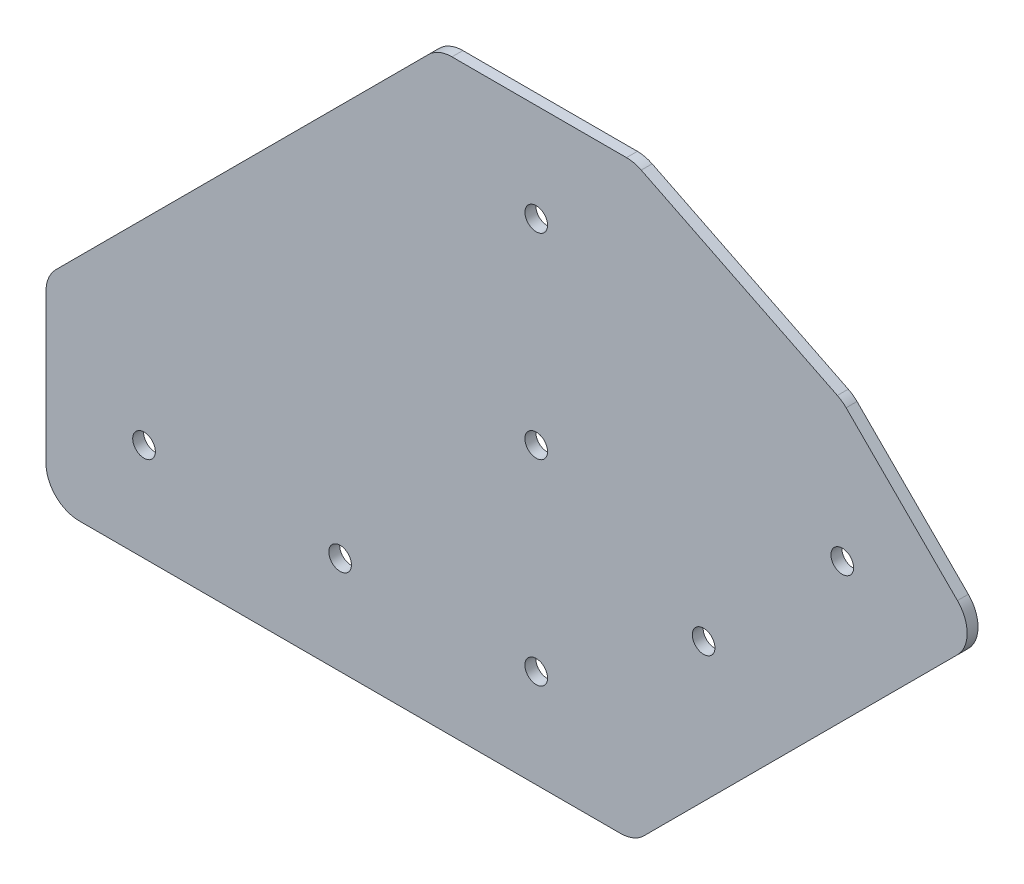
ISO-10303-21;
HEADER;
FILE_DESCRIPTION(('STEP AP214'),'2;1');
FILE_NAME('part.step','',(''),(''),'','','');
FILE_SCHEMA(('AUTOMOTIVE_DESIGN { 1 0 10303 214 1 1 1 1 }'));
ENDSEC;
DATA;
#1=APPLICATION_CONTEXT('core data for automotive mechanical design processes');
#2=APPLICATION_PROTOCOL_DEFINITION('international standard','automotive_design',2000,#1);
#3=PRODUCT_CONTEXT('',#1,'mechanical');
#4=PRODUCT('Part','Part','',(#3));
#5=PRODUCT_RELATED_PRODUCT_CATEGORY('part','',(#4));
#6=PRODUCT_DEFINITION_FORMATION('','',#4);
#7=PRODUCT_DEFINITION_CONTEXT('part definition',#1,'design');
#8=PRODUCT_DEFINITION('design','',#6,#7);
#9=PRODUCT_DEFINITION_SHAPE('','',#8);
#10=(LENGTH_UNIT() NAMED_UNIT(*) SI_UNIT(.MILLI.,.METRE.));
#11=(NAMED_UNIT(*) PLANE_ANGLE_UNIT() SI_UNIT($,.RADIAN.));
#12=(NAMED_UNIT(*) SI_UNIT($,.STERADIAN.) SOLID_ANGLE_UNIT());
#13=UNCERTAINTY_MEASURE_WITH_UNIT(LENGTH_MEASURE(1.E-05),#10,'distance_accuracy_value','');
#14=(GEOMETRIC_REPRESENTATION_CONTEXT(3) GLOBAL_UNCERTAINTY_ASSIGNED_CONTEXT((#13)) GLOBAL_UNIT_ASSIGNED_CONTEXT((#10,
#11,#12)) REPRESENTATION_CONTEXT('',''));
#15=CARTESIAN_POINT('',(0.,0.,0.));
#16=DIRECTION('',(0.,0.,1.));
#17=DIRECTION('',(1.,0.,0.));
#18=AXIS2_PLACEMENT_3D('',#15,#16,#17);
#19=CARTESIAN_POINT('',(4.841875,0.,0.));
#20=DIRECTION('',(0.,1.,0.));
#21=DIRECTION('',(0.,0.,1.));
#22=AXIS2_PLACEMENT_3D('',#19,#20,#21);
#23=PLANE('',#22);
#24=DIRECTION('',(0.,0.,-1.));
#25=VECTOR('',#24,1.);
#26=CARTESIAN_POINT('',(83.7194297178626,0.,0.79375));
#27=LINE('',#26,#25);
#28=CARTESIAN_POINT('',(83.7194297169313,0.,0.));
#29=VERTEX_POINT('',#28);
#30=CARTESIAN_POINT('',(83.7194297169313,0.,1.5875));
#31=VERTEX_POINT('',#30);
#32=EDGE_CURVE('E178',#29,#31,#27,.F.);
#33=ORIENTED_EDGE('',*,*,#32,.T.);
#34=DIRECTION('',(1.,0.,0.));
#35=VECTOR('',#34,1.);
#36=CARTESIAN_POINT('',(67.5193853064,0.,1.5875));
#37=LINE('',#36,#35);
#38=CARTESIAN_POINT('',(4.84187500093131,0.,1.5875));
#39=VERTEX_POINT('',#38);
#40=EDGE_CURVE('E223',#39,#31,#37,.T.);
#41=ORIENTED_EDGE('',*,*,#40,.F.);
#42=DIRECTION('',(0.,0.,1.));
#43=VECTOR('',#42,1.);
#44=CARTESIAN_POINT('',(4.84187500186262,0.,0.79375));
#45=LINE('',#44,#43);
#46=CARTESIAN_POINT('',(4.84187500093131,0.,0.));
#47=VERTEX_POINT('',#46);
#48=EDGE_CURVE('E142',#39,#47,#45,.F.);
#49=ORIENTED_EDGE('',*,*,#48,.T.);
#50=DIRECTION('',(1.,0.,0.));
#51=VECTOR('',#50,1.);
#52=CARTESIAN_POINT('',(67.5193853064,0.,0.));
#53=LINE('',#52,#51);
#54=EDGE_CURVE('E247',#47,#29,#53,.T.);
#55=ORIENTED_EDGE('',*,*,#54,.T.);
#56=EDGE_LOOP('',(#33,#41,#49,#55));
#57=FACE_BOUND('',#56,.T.);
#58=ADVANCED_FACE('F16',(#57),#23,.F.);
#59=CARTESIAN_POINT('',(83.719429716,4.841875,1.5875));
#60=DIRECTION('',(0.,0.,-1.));
#61=DIRECTION('',(0.,1.,0.));
#62=AXIS2_PLACEMENT_3D('',#59,#60,#61);
#63=CYLINDRICAL_SURFACE('',#62,4.841875);
#64=ORIENTED_EDGE('',*,*,#32,.F.);
#65=CARTESIAN_POINT('',(83.719429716,4.841875,0.));
#66=DIRECTION('',(0.,0.,-1.));
#67=DIRECTION('',(0.,1.,0.));
#68=AXIS2_PLACEMENT_3D('',#65,#66,#67);
#69=CIRCLE('',#68,4.841875);
#70=CARTESIAN_POINT('',(87.143152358,1.418152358,0.));
#71=VERTEX_POINT('',#70);
#72=EDGE_CURVE('E244',#29,#71,#69,.F.);
#73=ORIENTED_EDGE('',*,*,#72,.T.);
#74=DIRECTION('',(0.,0.,1.));
#75=VECTOR('',#74,1.);
#76=CARTESIAN_POINT('',(87.143152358,1.418152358,0.79375));
#77=LINE('',#76,#75);
#78=CARTESIAN_POINT('',(87.1431523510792,1.41815236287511,1.5875));
#79=VERTEX_POINT('',#78);
#80=EDGE_CURVE('E175',#71,#79,#77,.T.);
#81=ORIENTED_EDGE('',*,*,#80,.T.);
#82=CARTESIAN_POINT('',(83.719429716,4.841875,1.5875));
#83=DIRECTION('',(0.,0.,-1.));
#84=DIRECTION('',(0.,1.,0.));
#85=AXIS2_PLACEMENT_3D('',#82,#83,#84);
#86=CIRCLE('',#85,4.841875);
#87=EDGE_CURVE('E221',#31,#79,#86,.F.);
#88=ORIENTED_EDGE('',*,*,#87,.F.);
#89=EDGE_LOOP('',(#64,#73,#81,#88));
#90=FACE_BOUND('',#89,.T.);
#91=ADVANCED_FACE('F278',(#90),#63,.T.);
#92=CARTESIAN_POINT('',(132.8152180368,47.0902180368,0.));
#93=DIRECTION('',(-0.707106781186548,0.707106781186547,0.));
#94=DIRECTION('',(-0.707106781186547,-0.707106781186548,0.));
#95=AXIS2_PLACEMENT_3D('',#92,#93,#94);
#96=PLANE('',#95);
#97=ORIENTED_EDGE('',*,*,#80,.F.);
#98=DIRECTION('',(-0.707106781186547,-0.707106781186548,0.));
#99=VECTOR('',#98,1.);
#100=CARTESIAN_POINT('',(132.8152180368,47.0902180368,0.));
#101=LINE('',#100,#99);
#102=CARTESIAN_POINT('',(132.815218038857,47.0902180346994,0.));
#103=VERTEX_POINT('',#102);
#104=EDGE_CURVE('E242',#71,#103,#101,.F.);
#105=ORIENTED_EDGE('',*,*,#104,.T.);
#106=DIRECTION('',(0.,0.,-1.));
#107=VECTOR('',#106,1.);
#108=CARTESIAN_POINT('',(132.815218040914,47.0902180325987,0.79375));
#109=LINE('',#108,#107);
#110=CARTESIAN_POINT('',(132.815218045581,47.0902180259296,1.5875));
#111=VERTEX_POINT('',#110);
#112=EDGE_CURVE('E116',#103,#111,#109,.F.);
#113=ORIENTED_EDGE('',*,*,#112,.T.);
#114=DIRECTION('',(0.707106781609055,0.70710678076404,0.));
#115=VECTOR('',#114,1.);
#116=CARTESIAN_POINT('',(87.1431523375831,1.418152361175,1.5875));
#117=LINE('',#116,#115);
#118=EDGE_CURVE('E219',#79,#111,#117,.T.);
#119=ORIENTED_EDGE('',*,*,#118,.F.);
#120=EDGE_LOOP('',(#97,#105,#113,#119));
#121=FACE_BOUND('',#120,.T.);
#122=ADVANCED_FACE('F274',(#121),#96,.F.);
#123=CARTESIAN_POINT('',(129.3914953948,50.5139406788,1.5875));
#124=DIRECTION('',(0.,0.,-1.));
#125=DIRECTION('',(0.,1.,0.));
#126=AXIS2_PLACEMENT_3D('',#123,#124,#125);
#127=CYLINDRICAL_SURFACE('',#126,4.84187499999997);
#128=ORIENTED_EDGE('',*,*,#112,.F.);
#129=CARTESIAN_POINT('',(129.3914953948,50.5139406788,0.));
#130=DIRECTION('',(0.,0.,-1.));
#131=DIRECTION('',(0.,1.,0.));
#132=AXIS2_PLACEMENT_3D('',#129,#130,#131);
#133=CIRCLE('',#132,4.84187499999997);
#134=CARTESIAN_POINT('',(132.8152180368,53.9376633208,0.));
#135=VERTEX_POINT('',#134);
#136=EDGE_CURVE('E20',#103,#135,#133,.F.);
#137=ORIENTED_EDGE('',*,*,#136,.T.);
#138=DIRECTION('',(0.,0.,1.));
#139=VECTOR('',#138,1.);
#140=CARTESIAN_POINT('',(132.8152180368,53.9376633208,0.79375));
#141=LINE('',#140,#139);
#142=CARTESIAN_POINT('',(132.815218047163,53.937663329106,1.5875));
#143=VERTEX_POINT('',#142);
#144=EDGE_CURVE('E123',#135,#143,#141,.T.);
#145=ORIENTED_EDGE('',*,*,#144,.T.);
#146=CARTESIAN_POINT('',(129.3914953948,50.5139406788,1.5875));
#147=DIRECTION('',(0.,0.,-1.));
#148=DIRECTION('',(0.,1.,0.));
#149=AXIS2_PLACEMENT_3D('',#146,#147,#148);
#150=CIRCLE('',#149,4.84187499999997);
#151=EDGE_CURVE('E217',#111,#143,#150,.F.);
#152=ORIENTED_EDGE('',*,*,#151,.F.);
#153=EDGE_LOOP('',(#128,#137,#145,#152));
#154=FACE_BOUND('',#153,.T.);
#155=ADVANCED_FACE('F140',(#154),#127,.T.);
#156=CARTESIAN_POINT('',(116.5958697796,70.157011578,0.));
#157=DIRECTION('',(-0.707106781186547,-0.707106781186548,0.));
#158=DIRECTION('',(0.707106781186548,-0.707106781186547,0.));
#159=AXIS2_PLACEMENT_3D('',#156,#157,#158);
#160=PLANE('',#159);
#161=ORIENTED_EDGE('',*,*,#144,.F.);
#162=DIRECTION('',(0.707106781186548,-0.707106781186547,0.));
#163=VECTOR('',#162,1.);
#164=CARTESIAN_POINT('',(116.5958697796,70.157011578,0.));
#165=LINE('',#164,#163);
#166=CARTESIAN_POINT('',(116.59586978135,70.1570115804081,0.));
#167=VERTEX_POINT('',#166);
#168=EDGE_CURVE('E127',#135,#167,#165,.F.);
#169=ORIENTED_EDGE('',*,*,#168,.T.);
#170=DIRECTION('',(0.,0.,-1.));
#171=VECTOR('',#170,1.);
#172=CARTESIAN_POINT('',(116.595869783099,70.1570115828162,0.79375));
#173=LINE('',#172,#171);
#174=CARTESIAN_POINT('',(116.595869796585,70.1570115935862,1.5875));
#175=VERTEX_POINT('',#174);
#176=EDGE_CURVE('E129',#167,#175,#173,.F.);
#177=ORIENTED_EDGE('',*,*,#176,.T.);
#178=DIRECTION('',(-0.707106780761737,0.707106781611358,0.));
#179=VECTOR('',#178,1.);
#180=CARTESIAN_POINT('',(132.815218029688,53.93766336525,1.5875));
#181=LINE('',#180,#179);
#182=EDGE_CURVE('E128',#143,#175,#181,.T.);
#183=ORIENTED_EDGE('',*,*,#182,.F.);
#184=EDGE_LOOP('',(#161,#169,#177,#183));
#185=FACE_BOUND('',#184,.T.);
#186=ADVANCED_FACE('F125',(#185),#160,.F.);
#187=CARTESIAN_POINT('',(113.1721471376,66.733288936,1.5875));
#188=DIRECTION('',(0.,0.,-1.));
#189=DIRECTION('',(0.,1.,0.));
#190=AXIS2_PLACEMENT_3D('',#187,#188,#189);
#191=CYLINDRICAL_SURFACE('',#190,4.84187500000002);
#192=ORIENTED_EDGE('',*,*,#176,.F.);
#193=CARTESIAN_POINT('',(113.1721471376,66.733288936,0.));
#194=DIRECTION('',(0.,0.,-1.));
#195=DIRECTION('',(0.,1.,0.));
#196=AXIS2_PLACEMENT_3D('',#193,#194,#195);
#197=CIRCLE('',#196,4.84187500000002);
#198=CARTESIAN_POINT('',(115.32045155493,71.0724756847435,0.));
#199=VERTEX_POINT('',#198);
#200=EDGE_CURVE('E139',#167,#199,#197,.F.);
#201=ORIENTED_EDGE('',*,*,#200,.T.);
#202=DIRECTION('',(0.,0.,1.));
#203=VECTOR('',#202,1.);
#204=CARTESIAN_POINT('',(115.3204515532,71.0724756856,0.79375));
#205=LINE('',#204,#203);
#206=CARTESIAN_POINT('',(115.320451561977,71.0724757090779,1.5875));
#207=VERTEX_POINT('',#206);
#208=EDGE_CURVE('E170',#199,#207,#205,.T.);
#209=ORIENTED_EDGE('',*,*,#208,.T.);
#210=CARTESIAN_POINT('',(113.1721471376,66.733288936,1.5875));
#211=DIRECTION('',(0.,0.,-1.));
#212=DIRECTION('',(0.,1.,0.));
#213=AXIS2_PLACEMENT_3D('',#210,#211,#212);
#214=CIRCLE('',#213,4.84187500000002);
#215=EDGE_CURVE('E214',#175,#207,#214,.F.);
#216=ORIENTED_EDGE('',*,*,#215,.F.);
#217=EDGE_LOOP('',(#192,#201,#209,#216));
#218=FACE_BOUND('',#217,.T.);
#219=ADVANCED_FACE('F268',(#218),#191,.T.);
#220=CARTESIAN_POINT('',(86.7403394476,85.2223117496,0.));
#221=DIRECTION('',(-0.443692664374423,-0.896179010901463,0.));
#222=DIRECTION('',(0.896179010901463,-0.443692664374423,0.));
#223=AXIS2_PLACEMENT_3D('',#220,#221,#222);
#224=PLANE('',#223);
#225=ORIENTED_EDGE('',*,*,#208,.F.);
#226=DIRECTION('',(0.896179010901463,-0.443692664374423,0.));
#227=VECTOR('',#226,1.);
#228=CARTESIAN_POINT('',(86.7403394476,85.2223117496,0.));
#229=LINE('',#228,#227);
#230=CARTESIAN_POINT('',(86.7403394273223,85.2223117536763,0.));
#231=VERTEX_POINT('',#230);
#232=EDGE_CURVE('E264',#199,#231,#229,.F.);
#233=ORIENTED_EDGE('',*,*,#232,.T.);
#234=DIRECTION('',(0.,0.,-1.));
#235=VECTOR('',#234,1.);
#236=CARTESIAN_POINT('',(86.7403394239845,85.2223117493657,0.79375));
#237=LINE('',#236,#235);
#238=CARTESIAN_POINT('',(86.7403394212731,85.2223117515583,1.5875));
#239=VERTEX_POINT('',#238);
#240=EDGE_CURVE('E167',#231,#239,#237,.F.);
#241=ORIENTED_EDGE('',*,*,#240,.T.);
#242=DIRECTION('',(-0.896179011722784,0.443692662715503,0.));
#243=VECTOR('',#242,1.);
#244=CARTESIAN_POINT('',(115.320451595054,71.072475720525,1.5875));
#245=LINE('',#244,#243);
#246=EDGE_CURVE('E212',#207,#239,#245,.T.);
#247=ORIENTED_EDGE('',*,*,#246,.F.);
#248=EDGE_LOOP('',(#225,#233,#241,#247));
#249=FACE_BOUND('',#248,.T.);
#250=ADVANCED_FACE('F309',(#249),#224,.F.);
#251=CARTESIAN_POINT('',(84.5920350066,80.883125,1.5875));
#252=DIRECTION('',(0.,0.,-1.));
#253=DIRECTION('',(0.,1.,0.));
#254=AXIS2_PLACEMENT_3D('',#251,#252,#253);
#255=CYLINDRICAL_SURFACE('',#254,4.841875);
#256=ORIENTED_EDGE('',*,*,#240,.F.);
#257=CARTESIAN_POINT('',(84.5920350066,80.883125,0.));
#258=DIRECTION('',(0.,0.,-1.));
#259=DIRECTION('',(0.,1.,0.));
#260=AXIS2_PLACEMENT_3D('',#257,#258,#259);
#261=CIRCLE('',#260,4.841875);
#262=CARTESIAN_POINT('',(84.5920350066,85.725,0.));
#263=VERTEX_POINT('',#262);
#264=EDGE_CURVE('E261',#231,#263,#261,.F.);
#265=ORIENTED_EDGE('',*,*,#264,.T.);
#266=DIRECTION('',(0.,0.,1.));
#267=VECTOR('',#266,1.);
#268=CARTESIAN_POINT('',(84.5920350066,85.725,0.79375));
#269=LINE('',#268,#267);
#270=CARTESIAN_POINT('',(84.5920350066,85.725,1.5875));
#271=VERTEX_POINT('',#270);
#272=EDGE_CURVE('E164',#263,#271,#269,.T.);
#273=ORIENTED_EDGE('',*,*,#272,.T.);
#274=CARTESIAN_POINT('',(84.5920350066,80.883125,1.5875));
#275=DIRECTION('',(0.,0.,-1.));
#276=DIRECTION('',(0.,1.,0.));
#277=AXIS2_PLACEMENT_3D('',#274,#275,#276);
#278=CIRCLE('',#277,4.841875);
#279=EDGE_CURVE('E210',#239,#271,#278,.F.);
#280=ORIENTED_EDGE('',*,*,#279,.F.);
#281=EDGE_LOOP('',(#256,#265,#273,#280));
#282=FACE_BOUND('',#281,.T.);
#283=ADVANCED_FACE('F306',(#282),#255,.T.);
#284=CARTESIAN_POINT('',(59.155570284,85.725,0.));
#285=DIRECTION('',(0.,-1.,0.));
#286=DIRECTION('',(1.,0.,0.));
#287=AXIS2_PLACEMENT_3D('',#284,#285,#286);
#288=PLANE('',#287);
#289=ORIENTED_EDGE('',*,*,#272,.F.);
#290=DIRECTION('',(-1.,0.,0.));
#291=VECTOR('',#290,1.);
#292=CARTESIAN_POINT('',(67.5193853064,85.725,0.));
#293=LINE('',#292,#291);
#294=CARTESIAN_POINT('',(59.1555702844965,85.725,0.));
#295=VERTEX_POINT('',#294);
#296=EDGE_CURVE('E150',#263,#295,#293,.T.);
#297=ORIENTED_EDGE('',*,*,#296,.T.);
#298=DIRECTION('',(0.,0.,-1.));
#299=VECTOR('',#298,1.);
#300=CARTESIAN_POINT('',(59.1555702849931,85.725,0.79375));
#301=LINE('',#300,#299);
#302=CARTESIAN_POINT('',(59.1555702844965,85.725,1.5875));
#303=VERTEX_POINT('',#302);
#304=EDGE_CURVE('E161',#295,#303,#301,.F.);
#305=ORIENTED_EDGE('',*,*,#304,.T.);
#306=DIRECTION('',(-1.,0.,0.));
#307=VECTOR('',#306,1.);
#308=CARTESIAN_POINT('',(67.5193853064,85.725,1.5875));
#309=LINE('',#308,#307);
#310=EDGE_CURVE('E209',#271,#303,#309,.T.);
#311=ORIENTED_EDGE('',*,*,#310,.F.);
#312=EDGE_LOOP('',(#289,#297,#305,#311));
#313=FACE_BOUND('',#312,.T.);
#314=ADVANCED_FACE('F303',(#313),#288,.F.);
#315=CARTESIAN_POINT('',(59.155570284,80.883125,1.5875));
#316=DIRECTION('',(0.,0.,-1.));
#317=DIRECTION('',(0.,1.,0.));
#318=AXIS2_PLACEMENT_3D('',#315,#316,#317);
#319=CYLINDRICAL_SURFACE('',#318,4.84187499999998);
#320=ORIENTED_EDGE('',*,*,#304,.F.);
#321=CARTESIAN_POINT('',(59.155570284,80.883125,0.));
#322=DIRECTION('',(0.,0.,-1.));
#323=DIRECTION('',(0.,1.,0.));
#324=AXIS2_PLACEMENT_3D('',#321,#322,#323);
#325=CIRCLE('',#324,4.84187499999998);
#326=CARTESIAN_POINT('',(55.731847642,84.306847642,0.));
#327=VERTEX_POINT('',#326);
#328=EDGE_CURVE('E258',#295,#327,#325,.F.);
#329=ORIENTED_EDGE('',*,*,#328,.T.);
#330=DIRECTION('',(0.,0.,1.));
#331=VECTOR('',#330,1.);
#332=CARTESIAN_POINT('',(55.731847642,84.306847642,0.79375));
#333=LINE('',#332,#331);
#334=CARTESIAN_POINT('',(55.731847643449,84.3068476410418,1.5875));
#335=VERTEX_POINT('',#334);
#336=EDGE_CURVE('E158',#327,#335,#333,.T.);
#337=ORIENTED_EDGE('',*,*,#336,.T.);
#338=CARTESIAN_POINT('',(59.155570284,80.883125,1.5875));
#339=DIRECTION('',(0.,0.,-1.));
#340=DIRECTION('',(0.,1.,0.));
#341=AXIS2_PLACEMENT_3D('',#338,#339,#340);
#342=CIRCLE('',#341,4.84187499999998);
#343=EDGE_CURVE('E207',#303,#335,#342,.F.);
#344=ORIENTED_EDGE('',*,*,#343,.F.);
#345=EDGE_LOOP('',(#320,#329,#337,#344));
#346=FACE_BOUND('',#345,.T.);
#347=ADVANCED_FACE('F299',(#346),#319,.T.);
#348=CARTESIAN_POINT('',(1.418152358,29.993152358,0.));
#349=DIRECTION('',(0.707106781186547,-0.707106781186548,0.));
#350=DIRECTION('',(0.707106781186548,0.707106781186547,0.));
#351=AXIS2_PLACEMENT_3D('',#348,#349,#350);
#352=PLANE('',#351);
#353=ORIENTED_EDGE('',*,*,#336,.F.);
#354=DIRECTION('',(0.707106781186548,0.707106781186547,0.));
#355=VECTOR('',#354,1.);
#356=CARTESIAN_POINT('',(1.418152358,29.993152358,0.));
#357=LINE('',#356,#355);
#358=CARTESIAN_POINT('',(1.41815235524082,29.9931523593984,0.));
#359=VERTEX_POINT('',#358);
#360=EDGE_CURVE('E255',#327,#359,#357,.F.);
#361=ORIENTED_EDGE('',*,*,#360,.T.);
#362=DIRECTION('',(0.,0.,-1.));
#363=VECTOR('',#362,1.);
#364=CARTESIAN_POINT('',(1.41815235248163,29.9931523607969,0.79375));
#365=LINE('',#364,#363);
#366=CARTESIAN_POINT('',(1.41815235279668,29.9931523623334,1.5875));
#367=VERTEX_POINT('',#366);
#368=EDGE_CURVE('E155',#359,#367,#365,.F.);
#369=ORIENTED_EDGE('',*,*,#368,.T.);
#370=DIRECTION('',(-0.707106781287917,-0.707106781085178,0.));
#371=VECTOR('',#370,1.);
#372=CARTESIAN_POINT('',(55.7318476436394,84.306847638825,1.5875));
#373=LINE('',#372,#371);
#374=EDGE_CURVE('E205',#335,#367,#373,.T.);
#375=ORIENTED_EDGE('',*,*,#374,.F.);
#376=EDGE_LOOP('',(#353,#361,#369,#375));
#377=FACE_BOUND('',#376,.T.);
#378=ADVANCED_FACE('F294',(#377),#352,.F.);
#379=CARTESIAN_POINT('',(4.841875,26.569429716,1.5875));
#380=DIRECTION('',(0.,0.,-1.));
#381=DIRECTION('',(0.,1.,0.));
#382=AXIS2_PLACEMENT_3D('',#379,#380,#381);
#383=CYLINDRICAL_SURFACE('',#382,4.841875);
#384=ORIENTED_EDGE('',*,*,#368,.F.);
#385=CARTESIAN_POINT('',(4.841875,26.569429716,0.));
#386=DIRECTION('',(0.,0.,-1.));
#387=DIRECTION('',(0.,1.,0.));
#388=AXIS2_PLACEMENT_3D('',#385,#386,#387);
#389=CIRCLE('',#388,4.841875);
#390=CARTESIAN_POINT('',(0.,26.569429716,0.));
#391=VERTEX_POINT('',#390);
#392=EDGE_CURVE('E252',#359,#391,#389,.F.);
#393=ORIENTED_EDGE('',*,*,#392,.T.);
#394=DIRECTION('',(0.,0.,1.));
#395=VECTOR('',#394,1.);
#396=CARTESIAN_POINT('',(0.,26.569429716,0.79375));
#397=LINE('',#396,#395);
#398=CARTESIAN_POINT('',(0.,26.569429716,1.5875));
#399=VERTEX_POINT('',#398);
#400=EDGE_CURVE('E147',#391,#399,#397,.T.);
#401=ORIENTED_EDGE('',*,*,#400,.T.);
#402=CARTESIAN_POINT('',(4.841875,26.569429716,1.5875));
#403=DIRECTION('',(0.,0.,-1.));
#404=DIRECTION('',(0.,1.,0.));
#405=AXIS2_PLACEMENT_3D('',#402,#403,#404);
#406=CIRCLE('',#405,4.841875);
#407=EDGE_CURVE('E203',#367,#399,#406,.F.);
#408=ORIENTED_EDGE('',*,*,#407,.F.);
#409=EDGE_LOOP('',(#384,#393,#401,#408));
#410=FACE_BOUND('',#409,.T.);
#411=ADVANCED_FACE('F290',(#410),#383,.T.);
#412=CARTESIAN_POINT('',(0.,4.841875,0.));
#413=DIRECTION('',(1.,0.,0.));
#414=DIRECTION('',(0.,1.,0.));
#415=AXIS2_PLACEMENT_3D('',#412,#413,#414);
#416=PLANE('',#415);
#417=DIRECTION('',(0.,0.,-1.));
#418=VECTOR('',#417,1.);
#419=CARTESIAN_POINT('',(0.,4.84187499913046,0.79375));
#420=LINE('',#419,#418);
#421=CARTESIAN_POINT('',(0.,4.84187499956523,0.));
#422=VERTEX_POINT('',#421);
#423=CARTESIAN_POINT('',(0.,4.84187499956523,1.5875));
#424=VERTEX_POINT('',#423);
#425=EDGE_CURVE('E141',#422,#424,#420,.F.);
#426=ORIENTED_EDGE('',*,*,#425,.T.);
#427=DIRECTION('',(0.,-1.,0.));
#428=VECTOR('',#427,1.);
#429=CARTESIAN_POINT('',(0.,42.8625,1.5875));
#430=LINE('',#429,#428);
#431=EDGE_CURVE('E35',#399,#424,#430,.T.);
#432=ORIENTED_EDGE('',*,*,#431,.F.);
#433=ORIENTED_EDGE('',*,*,#400,.F.);
#434=DIRECTION('',(0.,-1.,0.));
#435=VECTOR('',#434,1.);
#436=CARTESIAN_POINT('',(0.,42.8625,0.));
#437=LINE('',#436,#435);
#438=EDGE_CURVE('E251',#391,#422,#437,.T.);
#439=ORIENTED_EDGE('',*,*,#438,.T.);
#440=EDGE_LOOP('',(#426,#432,#433,#439));
#441=FACE_BOUND('',#440,.T.);
#442=ADVANCED_FACE('F286',(#441),#416,.F.);
#443=CARTESIAN_POINT('',(4.841875,4.841875,1.5875));
#444=DIRECTION('',(0.,0.,-1.));
#445=DIRECTION('',(0.,1.,0.));
#446=AXIS2_PLACEMENT_3D('',#443,#444,#445);
#447=CYLINDRICAL_SURFACE('',#446,4.841875);
#448=ORIENTED_EDGE('',*,*,#425,.F.);
#449=CARTESIAN_POINT('',(4.841875,4.841875,0.));
#450=DIRECTION('',(0.,0.,-1.));
#451=DIRECTION('',(0.,1.,0.));
#452=AXIS2_PLACEMENT_3D('',#449,#450,#451);
#453=CIRCLE('',#452,4.841875);
#454=EDGE_CURVE('E248',#422,#47,#453,.F.);
#455=ORIENTED_EDGE('',*,*,#454,.T.);
#456=ORIENTED_EDGE('',*,*,#48,.F.);
#457=CARTESIAN_POINT('',(4.841875,4.841875,1.5875));
#458=DIRECTION('',(0.,0.,-1.));
#459=DIRECTION('',(0.,1.,0.));
#460=AXIS2_PLACEMENT_3D('',#457,#458,#459);
#461=CIRCLE('',#460,4.841875);
#462=EDGE_CURVE('E201',#424,#39,#461,.F.);
#463=ORIENTED_EDGE('',*,*,#462,.F.);
#464=EDGE_LOOP('',(#448,#455,#456,#463));
#465=FACE_BOUND('',#464,.T.);
#466=ADVANCED_FACE('F354',(#465),#447,.T.);
#467=CARTESIAN_POINT('',(71.4375,42.8625,0.));
#468=DIRECTION('',(0.,0.,1.));
#469=DIRECTION('',(1.,0.,0.));
#470=AXIS2_PLACEMENT_3D('',#467,#468,#469);
#471=CYLINDRICAL_SURFACE('',#470,1.651);
#472=CARTESIAN_POINT('',(71.4375,42.8625,1.5875));
#473=DIRECTION('',(0.,0.,1.));
#474=DIRECTION('',(1.,0.,0.));
#475=AXIS2_PLACEMENT_3D('',#472,#473,#474);
#476=CIRCLE('',#475,1.651);
#477=CARTESIAN_POINT('',(73.0885,42.8625,1.5875));
#478=VERTEX_POINT('',#477);
#479=EDGE_CURVE('E198',#478,#478,#476,.F.);
#480=ORIENTED_EDGE('',*,*,#479,.F.);
#481=EDGE_LOOP('',(#480));
#482=FACE_BOUND('',#481,.T.);
#483=CARTESIAN_POINT('',(71.4375,42.8625,0.));
#484=DIRECTION('',(0.,0.,1.));
#485=DIRECTION('',(1.,0.,0.));
#486=AXIS2_PLACEMENT_3D('',#483,#484,#485);
#487=CIRCLE('',#486,1.651);
#488=CARTESIAN_POINT('',(73.0885,42.8625,0.));
#489=VERTEX_POINT('',#488);
#490=EDGE_CURVE('E239',#489,#489,#487,.F.);
#491=ORIENTED_EDGE('',*,*,#490,.T.);
#492=EDGE_LOOP('',(#491));
#493=FACE_BOUND('',#492,.T.);
#494=ADVANCED_FACE('F350',(#482,#493),#471,.F.);
#495=CARTESIAN_POINT('',(14.2875,14.2875,0.));
#496=DIRECTION('',(0.,0.,1.));
#497=DIRECTION('',(1.,0.,0.));
#498=AXIS2_PLACEMENT_3D('',#495,#496,#497);
#499=CYLINDRICAL_SURFACE('',#498,1.651);
#500=CARTESIAN_POINT('',(14.2875,14.2875,1.5875));
#501=DIRECTION('',(0.,0.,1.));
#502=DIRECTION('',(1.,0.,0.));
#503=AXIS2_PLACEMENT_3D('',#500,#501,#502);
#504=CIRCLE('',#503,1.651);
#505=CARTESIAN_POINT('',(15.9385,14.2875,1.5875));
#506=VERTEX_POINT('',#505);
#507=EDGE_CURVE('E195',#506,#506,#504,.F.);
#508=ORIENTED_EDGE('',*,*,#507,.F.);
#509=EDGE_LOOP('',(#508));
#510=FACE_BOUND('',#509,.T.);
#511=CARTESIAN_POINT('',(14.2875,14.2875,0.));
#512=DIRECTION('',(0.,0.,1.));
#513=DIRECTION('',(1.,0.,0.));
#514=AXIS2_PLACEMENT_3D('',#511,#512,#513);
#515=CIRCLE('',#514,1.651);
#516=CARTESIAN_POINT('',(15.9385,14.2875,0.));
#517=VERTEX_POINT('',#516);
#518=EDGE_CURVE('E236',#517,#517,#515,.F.);
#519=ORIENTED_EDGE('',*,*,#518,.T.);
#520=EDGE_LOOP('',(#519));
#521=FACE_BOUND('',#520,.T.);
#522=ADVANCED_FACE('F346',(#510,#521),#499,.F.);
#523=CARTESIAN_POINT('',(42.8625,14.2875,0.));
#524=DIRECTION('',(0.,0.,1.));
#525=DIRECTION('',(1.,0.,0.));
#526=AXIS2_PLACEMENT_3D('',#523,#524,#525);
#527=CYLINDRICAL_SURFACE('',#526,1.65100000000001);
#528=CARTESIAN_POINT('',(42.8625,14.2875,1.5875));
#529=DIRECTION('',(0.,0.,1.));
#530=DIRECTION('',(1.,0.,0.));
#531=AXIS2_PLACEMENT_3D('',#528,#529,#530);
#532=CIRCLE('',#531,1.65100000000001);
#533=CARTESIAN_POINT('',(44.5135,14.2875,1.5875));
#534=VERTEX_POINT('',#533);
#535=EDGE_CURVE('E192',#534,#534,#532,.F.);
#536=ORIENTED_EDGE('',*,*,#535,.F.);
#537=EDGE_LOOP('',(#536));
#538=FACE_BOUND('',#537,.T.);
#539=CARTESIAN_POINT('',(42.8625,14.2875,0.));
#540=DIRECTION('',(0.,0.,1.));
#541=DIRECTION('',(1.,0.,0.));
#542=AXIS2_PLACEMENT_3D('',#539,#540,#541);
#543=CIRCLE('',#542,1.65100000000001);
#544=CARTESIAN_POINT('',(44.5135,14.2875,0.));
#545=VERTEX_POINT('',#544);
#546=EDGE_CURVE('E233',#545,#545,#543,.F.);
#547=ORIENTED_EDGE('',*,*,#546,.T.);
#548=EDGE_LOOP('',(#547));
#549=FACE_BOUND('',#548,.T.);
#550=ADVANCED_FACE('F342',(#538,#549),#527,.F.);
#551=CARTESIAN_POINT('',(95.8277881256,30.3083644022,0.));
#552=DIRECTION('',(0.,0.,1.));
#553=DIRECTION('',(1.,0.,0.));
#554=AXIS2_PLACEMENT_3D('',#551,#552,#553);
#555=CYLINDRICAL_SURFACE('',#554,1.651);
#556=CARTESIAN_POINT('',(95.8277881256,30.3083644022,1.5875));
#557=DIRECTION('',(0.,0.,1.));
#558=DIRECTION('',(1.,0.,0.));
#559=AXIS2_PLACEMENT_3D('',#556,#557,#558);
#560=CIRCLE('',#559,1.651);
#561=CARTESIAN_POINT('',(97.4787881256,30.3083644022,1.5875));
#562=VERTEX_POINT('',#561);
#563=EDGE_CURVE('E189',#562,#562,#560,.F.);
#564=ORIENTED_EDGE('',*,*,#563,.F.);
#565=EDGE_LOOP('',(#564));
#566=FACE_BOUND('',#565,.T.);
#567=CARTESIAN_POINT('',(95.8277881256,30.3083644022,0.));
#568=DIRECTION('',(0.,0.,1.));
#569=DIRECTION('',(1.,0.,0.));
#570=AXIS2_PLACEMENT_3D('',#567,#568,#569);
#571=CIRCLE('',#570,1.651);
#572=CARTESIAN_POINT('',(97.4787881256,30.3083644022,0.));
#573=VERTEX_POINT('',#572);
#574=EDGE_CURVE('E230',#573,#573,#571,.F.);
#575=ORIENTED_EDGE('',*,*,#574,.T.);
#576=EDGE_LOOP('',(#575));
#577=FACE_BOUND('',#576,.T.);
#578=ADVANCED_FACE('F338',(#566,#577),#555,.F.);
#579=CARTESIAN_POINT('',(116.0333644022,50.5139406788,0.));
#580=DIRECTION('',(0.,0.,1.));
#581=DIRECTION('',(1.,0.,0.));
#582=AXIS2_PLACEMENT_3D('',#579,#580,#581);
#583=CYLINDRICAL_SURFACE('',#582,1.65100000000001);
#584=CARTESIAN_POINT('',(116.0333644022,50.5139406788,1.5875));
#585=DIRECTION('',(0.,0.,1.));
#586=DIRECTION('',(1.,0.,0.));
#587=AXIS2_PLACEMENT_3D('',#584,#585,#586);
#588=CIRCLE('',#587,1.65100000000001);
#589=CARTESIAN_POINT('',(117.6843644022,50.5139406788,1.5875));
#590=VERTEX_POINT('',#589);
#591=EDGE_CURVE('E186',#590,#590,#588,.F.);
#592=ORIENTED_EDGE('',*,*,#591,.F.);
#593=EDGE_LOOP('',(#592));
#594=FACE_BOUND('',#593,.T.);
#595=CARTESIAN_POINT('',(116.0333644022,50.5139406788,0.));
#596=DIRECTION('',(0.,0.,1.));
#597=DIRECTION('',(1.,0.,0.));
#598=AXIS2_PLACEMENT_3D('',#595,#596,#597);
#599=CIRCLE('',#598,1.65100000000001);
#600=CARTESIAN_POINT('',(117.6843644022,50.5139406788,0.));
#601=VERTEX_POINT('',#600);
#602=EDGE_CURVE('E227',#601,#601,#599,.F.);
#603=ORIENTED_EDGE('',*,*,#602,.T.);
#604=EDGE_LOOP('',(#603));
#605=FACE_BOUND('',#604,.T.);
#606=ADVANCED_FACE('F334',(#594,#605),#583,.F.);
#607=CARTESIAN_POINT('',(71.4375,14.2875,0.));
#608=DIRECTION('',(0.,0.,1.));
#609=DIRECTION('',(1.,0.,0.));
#610=AXIS2_PLACEMENT_3D('',#607,#608,#609);
#611=CYLINDRICAL_SURFACE('',#610,1.651);
#612=CARTESIAN_POINT('',(71.4375,14.2875,1.5875));
#613=DIRECTION('',(0.,0.,1.));
#614=DIRECTION('',(1.,0.,0.));
#615=AXIS2_PLACEMENT_3D('',#612,#613,#614);
#616=CIRCLE('',#615,1.651);
#617=CARTESIAN_POINT('',(73.0885,14.2875,1.5875));
#618=VERTEX_POINT('',#617);
#619=EDGE_CURVE('E183',#618,#618,#616,.F.);
#620=ORIENTED_EDGE('',*,*,#619,.F.);
#621=EDGE_LOOP('',(#620));
#622=FACE_BOUND('',#621,.T.);
#623=CARTESIAN_POINT('',(71.4375,14.2875,0.));
#624=DIRECTION('',(0.,0.,1.));
#625=DIRECTION('',(1.,0.,0.));
#626=AXIS2_PLACEMENT_3D('',#623,#624,#625);
#627=CIRCLE('',#626,1.651);
#628=CARTESIAN_POINT('',(73.0885,14.2875,0.));
#629=VERTEX_POINT('',#628);
#630=EDGE_CURVE('E224',#629,#629,#627,.F.);
#631=ORIENTED_EDGE('',*,*,#630,.T.);
#632=EDGE_LOOP('',(#631));
#633=FACE_BOUND('',#632,.T.);
#634=ADVANCED_FACE('F331',(#622,#633),#611,.F.);
#635=CARTESIAN_POINT('',(0.,0.,0.));
#636=DIRECTION('',(0.,0.,1.));
#637=DIRECTION('',(1.,0.,0.));
#638=AXIS2_PLACEMENT_3D('',#635,#636,#637);
#639=PLANE('',#638);
#640=ORIENTED_EDGE('',*,*,#630,.F.);
#641=EDGE_LOOP('',(#640));
#642=FACE_BOUND('',#641,.T.);
#643=ORIENTED_EDGE('',*,*,#602,.F.);
#644=EDGE_LOOP('',(#643));
#645=FACE_BOUND('',#644,.T.);
#646=ORIENTED_EDGE('',*,*,#574,.F.);
#647=EDGE_LOOP('',(#646));
#648=FACE_BOUND('',#647,.T.);
#649=ORIENTED_EDGE('',*,*,#546,.F.);
#650=EDGE_LOOP('',(#649));
#651=FACE_BOUND('',#650,.T.);
#652=ORIENTED_EDGE('',*,*,#518,.F.);
#653=EDGE_LOOP('',(#652));
#654=FACE_BOUND('',#653,.T.);
#655=ORIENTED_EDGE('',*,*,#490,.F.);
#656=EDGE_LOOP('',(#655));
#657=FACE_BOUND('',#656,.T.);
#658=CARTESIAN_POINT('',(71.4375,71.4375,0.));
#659=DIRECTION('',(0.,0.,1.));
#660=DIRECTION('',(1.,0.,0.));
#661=AXIS2_PLACEMENT_3D('',#658,#659,#660);
#662=CIRCLE('',#661,1.651);
#663=CARTESIAN_POINT('',(73.0885,71.4375,0.));
#664=VERTEX_POINT('',#663);
#665=EDGE_CURVE('E26',#664,#664,#662,.F.);
#666=ORIENTED_EDGE('',*,*,#665,.F.);
#667=EDGE_LOOP('',(#666));
#668=FACE_BOUND('',#667,.T.);
#669=ORIENTED_EDGE('',*,*,#72,.F.);
#670=ORIENTED_EDGE('',*,*,#54,.F.);
#671=ORIENTED_EDGE('',*,*,#454,.F.);
#672=ORIENTED_EDGE('',*,*,#438,.F.);
#673=ORIENTED_EDGE('',*,*,#392,.F.);
#674=ORIENTED_EDGE('',*,*,#360,.F.);
#675=ORIENTED_EDGE('',*,*,#328,.F.);
#676=ORIENTED_EDGE('',*,*,#296,.F.);
#677=ORIENTED_EDGE('',*,*,#264,.F.);
#678=ORIENTED_EDGE('',*,*,#232,.F.);
#679=ORIENTED_EDGE('',*,*,#200,.F.);
#680=ORIENTED_EDGE('',*,*,#168,.F.);
#681=ORIENTED_EDGE('',*,*,#136,.F.);
#682=ORIENTED_EDGE('',*,*,#104,.F.);
#683=EDGE_LOOP('',(#669,#670,#671,#672,#673,#674,#675,#676,#677,#678,#679,#680,#681,#682));
#684=FACE_BOUND('',#683,.T.);
#685=ADVANCED_FACE('F134',(#642,#645,#648,#651,#654,#657,#668,#684),#639,.F.);
#686=CARTESIAN_POINT('',(0.,0.,1.5875));
#687=DIRECTION('',(0.,0.,1.));
#688=DIRECTION('',(1.,0.,0.));
#689=AXIS2_PLACEMENT_3D('',#686,#687,#688);
#690=PLANE('',#689);
#691=ORIENTED_EDGE('',*,*,#619,.T.);
#692=EDGE_LOOP('',(#691));
#693=FACE_BOUND('',#692,.T.);
#694=ORIENTED_EDGE('',*,*,#591,.T.);
#695=EDGE_LOOP('',(#694));
#696=FACE_BOUND('',#695,.T.);
#697=ORIENTED_EDGE('',*,*,#563,.T.);
#698=EDGE_LOOP('',(#697));
#699=FACE_BOUND('',#698,.T.);
#700=ORIENTED_EDGE('',*,*,#535,.T.);
#701=EDGE_LOOP('',(#700));
#702=FACE_BOUND('',#701,.T.);
#703=ORIENTED_EDGE('',*,*,#507,.T.);
#704=EDGE_LOOP('',(#703));
#705=FACE_BOUND('',#704,.T.);
#706=ORIENTED_EDGE('',*,*,#479,.T.);
#707=EDGE_LOOP('',(#706));
#708=FACE_BOUND('',#707,.T.);
#709=CARTESIAN_POINT('',(71.4375,71.4375,1.5875));
#710=DIRECTION('',(0.,0.,1.));
#711=DIRECTION('',(1.,0.,0.));
#712=AXIS2_PLACEMENT_3D('',#709,#710,#711);
#713=CIRCLE('',#712,1.651);
#714=CARTESIAN_POINT('',(73.0885,71.4375,1.5875));
#715=VERTEX_POINT('',#714);
#716=EDGE_CURVE('E10',#715,#715,#713,.T.);
#717=ORIENTED_EDGE('',*,*,#716,.F.);
#718=EDGE_LOOP('',(#717));
#719=FACE_BOUND('',#718,.T.);
#720=ORIENTED_EDGE('',*,*,#431,.T.);
#721=ORIENTED_EDGE('',*,*,#462,.T.);
#722=ORIENTED_EDGE('',*,*,#40,.T.);
#723=ORIENTED_EDGE('',*,*,#87,.T.);
#724=ORIENTED_EDGE('',*,*,#118,.T.);
#725=ORIENTED_EDGE('',*,*,#151,.T.);
#726=ORIENTED_EDGE('',*,*,#182,.T.);
#727=ORIENTED_EDGE('',*,*,#215,.T.);
#728=ORIENTED_EDGE('',*,*,#246,.T.);
#729=ORIENTED_EDGE('',*,*,#279,.T.);
#730=ORIENTED_EDGE('',*,*,#310,.T.);
#731=ORIENTED_EDGE('',*,*,#343,.T.);
#732=ORIENTED_EDGE('',*,*,#374,.T.);
#733=ORIENTED_EDGE('',*,*,#407,.T.);
#734=EDGE_LOOP('',(#720,#721,#722,#723,#724,#725,#726,#727,#728,#729,#730,#731,#732,#733));
#735=FACE_BOUND('',#734,.T.);
#736=ADVANCED_FACE('F18',(#693,#696,#699,#702,#705,#708,#719,#735),#690,.T.);
#737=CARTESIAN_POINT('',(71.4375,71.4375,0.));
#738=DIRECTION('',(0.,0.,1.));
#739=DIRECTION('',(1.,0.,0.));
#740=AXIS2_PLACEMENT_3D('',#737,#738,#739);
#741=CYLINDRICAL_SURFACE('',#740,1.651);
#742=ORIENTED_EDGE('',*,*,#665,.T.);
#743=EDGE_LOOP('',(#742));
#744=FACE_BOUND('',#743,.T.);
#745=ORIENTED_EDGE('',*,*,#716,.T.);
#746=EDGE_LOOP('',(#745));
#747=FACE_BOUND('',#746,.T.);
#748=ADVANCED_FACE('F321',(#744,#747),#741,.F.);
#749=CLOSED_SHELL('',(#58,#91,#122,#155,#186,#219,#250,#283,#314,#347,#378,#411,#442,#466,#494,
#522,#550,#578,#606,#634,#685,#736,#748));
#750=MANIFOLD_SOLID_BREP('B1',#749);
#751=ADVANCED_BREP_SHAPE_REPRESENTATION('',(#18,#750),#14);
#752=SHAPE_DEFINITION_REPRESENTATION(#9,#751);
ENDSEC;
END-ISO-10303-21;
